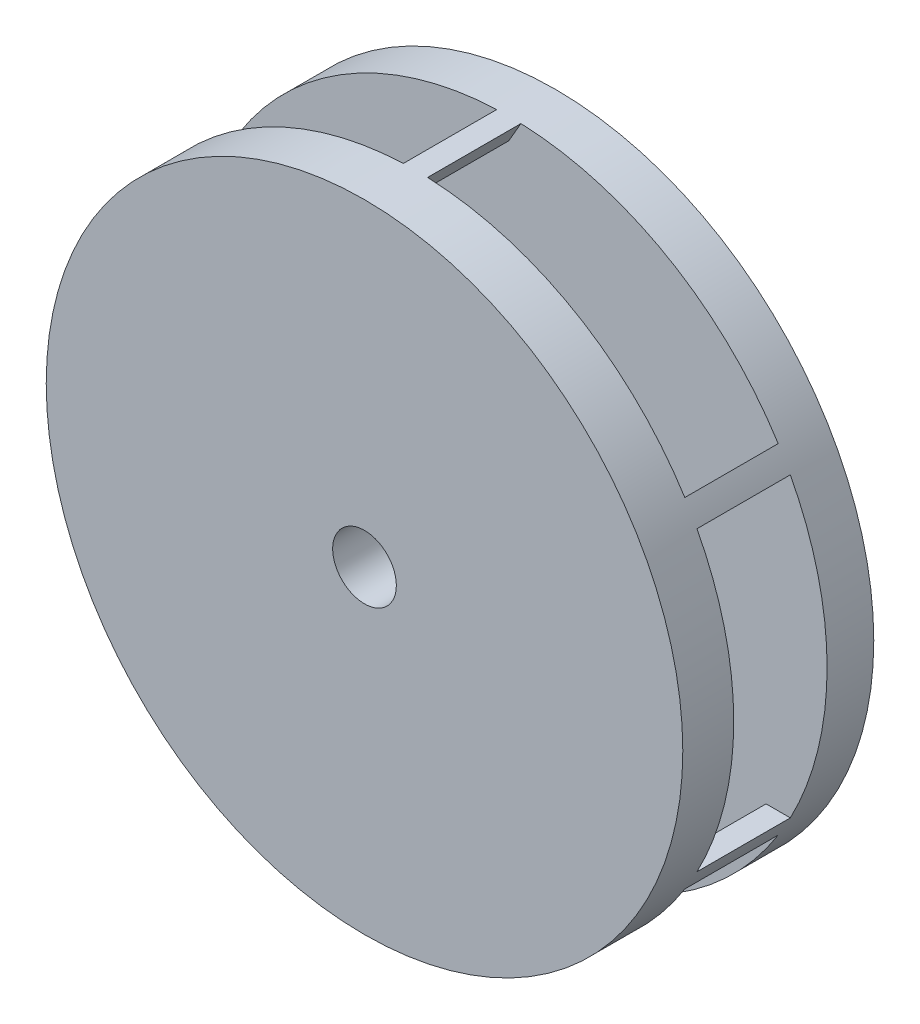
from build123d import *

# Parameters (mm, degrees)
CROQUIS1_R                 = 75
SALIENTE_EXTRUIR1_DEPTH    = 45
CROQUIS3_R                 = 30.5
CROQUIS3_R_2               = 25.5
SALIENTE_EXTRUIR2_DEPTH    = 15
CORTAR_EXTRUIR1_REACH      = 187.116
CORTAR_EXTRUIR1_END_RADIUS = 75
CORTAR_EXTRUIR2_DEPTH      = 174
CORTAR_EXTRUIR3_DEPTH      = 153
CORTAR_EXTRUIR4_REACH      = 117.217
CROQUIS9_R                 = 25.5
CORTAR_EXTRUIR5_REACH      = 123.861
CROQUIS10_R                = 7.5


with BuildPart() as part:
    # Croquis1 → Saliente-Extruir1 (new body)
    with BuildSketch(Plane.XY):
        with Locations(Location((0, 0, 0), (0, 0, 180))):
            Circle(CROQUIS1_R)
    extrude(amount=SALIENTE_EXTRUIR1_DEPTH)

    # Croquis3 → Saliente-Extruir2 (add)
    with BuildSketch(Plane(origin=(0, 0, 0), x_dir=(-1, 0, 0), z_dir=(0, 0, -1))):
        with Locations(Location((0, 0, 0), (0, 0, 180))):
            Circle(CROQUIS3_R)
        Circle(CROQUIS3_R_2, mode=Mode.SUBTRACT)
    extrude(amount=SALIENTE_EXTRUIR2_DEPTH)

    # Croquis4 → Revoluci_n1 (revolve)
    with BuildSketch(Plane(origin=(0, 0, 0), x_dir=(1, 0, 0), z_dir=(0, 1, 0)), mode=Mode.PRIVATE) as revoluci_n1_sk:
        with BuildLine():
            Line((-30.5, 0), (-65.5, 0))
            add(Edge.make_bspline(
                [(-65.5, 0), (-38.521374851, 2.276716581), (-30.5, 9)],
                knots=[0, 0, 0, 0.452791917, 0.452791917, 0.452791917], degree=2))
            Line((-30.5, 9), (-30.5, 0))
        make_face()
    revolve(revoluci_n1_sk.sketch.rotate(Axis((0, 0, 0), (0, 0, -1)), 180), axis=Axis((0, 0, 0), (0, 0, -1)))

    # Cortar-Extruir1: up to this cylinder (the profile starts inside it)
    cortar_extruir1_end = Plane(origin=(0, 0, 22), z_dir=(0, 0, -1)) * Cylinder(CORTAR_EXTRUIR1_END_RADIUS, 525.232, mode=Mode.PRIVATE)
    # Croquis6 → Cortar-Extruir1 (cut, up to the surface)
    with BuildSketch(Plane(origin=(37.5, -64.951905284, 0), x_dir=(0, 0, -1), z_dir=(0.499999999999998, -0.8660254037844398, 0)), mode=Mode.PRIVATE) as cortar_extruir1_sk1:
        Polygon((-11, 0), (-11, 35), (-33, 35), (-33, -35), (-11, -35), align=None)
    cortar_extruir1_tool1 = extrude(cortar_extruir1_sk1.sketch, amount=-CORTAR_EXTRUIR1_REACH, mode=Mode.PRIVATE) & cortar_extruir1_end
    add(cortar_extruir1_tool1.solids().sort_by_distance((37.5, -64.951905, 22))[0], mode=Mode.SUBTRACT)

    # Croquis7 → Cortar-Extruir2 (cut)
    with BuildSketch(Plane(origin=(37.5, 64.951905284, 0), x_dir=(0, 0, -1), z_dir=(0.5000000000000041, 0.8660254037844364, 0))):
        Polygon((-11, 0), (-11, 35), (-33, 35), (-33, -35), (-11, -35), align=None)
    extrude(amount=-CORTAR_EXTRUIR2_DEPTH, mode=Mode.SUBTRACT)

    # Croquis8 → Cortar-Extruir3 (cut)
    with BuildSketch(Plane(origin=(76.5, 0, 0), x_dir=(0, 0, -1), z_dir=(1, 0, 0))):
        Polygon((-11, 0), (-11, 35), (-33, 35), (-33, -35), (-11, -35), align=None)
    extrude(amount=-CORTAR_EXTRUIR3_DEPTH, mode=Mode.SUBTRACT)

    # Croquis9 → Cortar-Extruir4 (cut, up to next)
    with BuildSketch(Plane(origin=(0, 0, 0), x_dir=(-1, 0, 0), z_dir=(0, 0, -1)), mode=Mode.PRIVATE) as cortar_extruir4_sk1:
        Circle(CROQUIS9_R)
    cortar_extruir4_tool1 = extrude(cortar_extruir4_sk1.sketch, amount=-CORTAR_EXTRUIR4_REACH, mode=Mode.PRIVATE) & part.part
    add(cortar_extruir4_tool1.solids().sort_by_distance((0, 0, 0))[0], mode=Mode.SUBTRACT)

    # Croquis10 → Cortar-Extruir5 (cut, up to next)
    with BuildSketch(Plane.XY.offset(45), mode=Mode.PRIVATE) as cortar_extruir5_sk1:
        Circle(CROQUIS10_R)
    cortar_extruir5_tool1 = extrude(cortar_extruir5_sk1.sketch, amount=-CORTAR_EXTRUIR5_REACH, mode=Mode.PRIVATE) & part.part
    add(cortar_extruir5_tool1.solids().sort_by_distance((0, 0, 45))[0], mode=Mode.SUBTRACT)


solid = part.part
